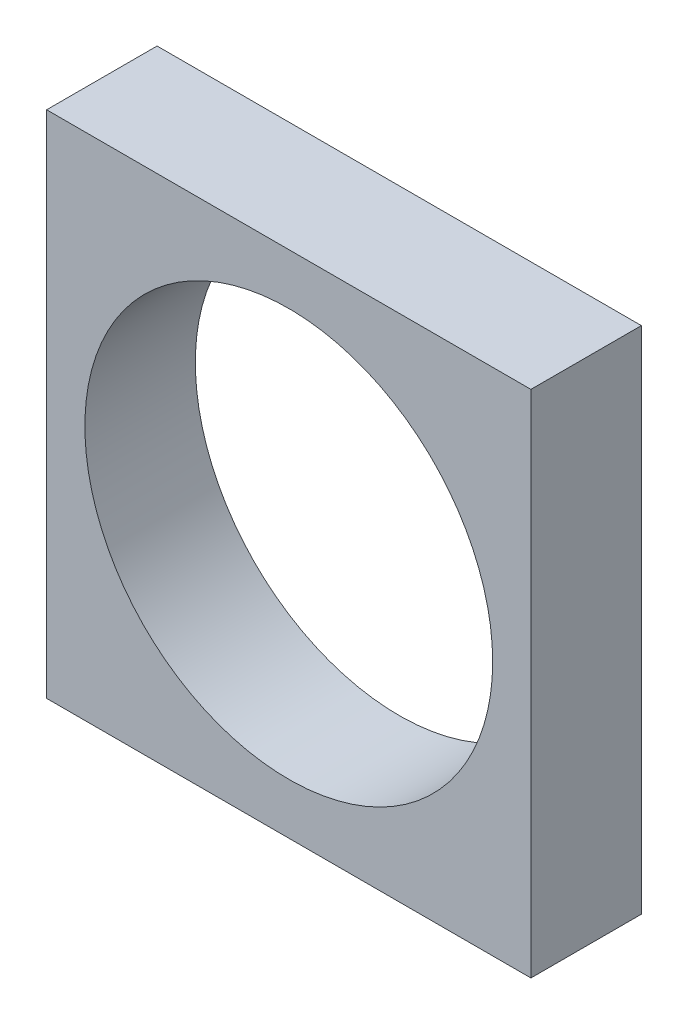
from build123d import *

# Parameters (mm, degrees)
ESQUISSE1_W             = 57
ESQUISSE1_H             = 60
EXTRUSION1_DEPTH        = 13
ESQUISSE2_R             = 24
ENL_V_MAT_EXTRU_1_DEPTH = 84.773504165


with BuildPart() as part:
    # Esquisse1 → Extrusion1 (new body)
    with BuildSketch(Plane.XY):
        with Locations((28.5, 30)):
            Rectangle(ESQUISSE1_W, ESQUISSE1_H)
    extrude(amount=EXTRUSION1_DEPTH)

    # Esquisse2 → Enl_v. mat.-Extru.1 (cut, through all)
    with BuildSketch(Plane.XY.offset(13)):
        with Locations((28.5, 30)):
            Circle(ESQUISSE2_R)
    extrude(amount=-ENL_V_MAT_EXTRU_1_DEPTH, mode=Mode.SUBTRACT)


solid = part.part
